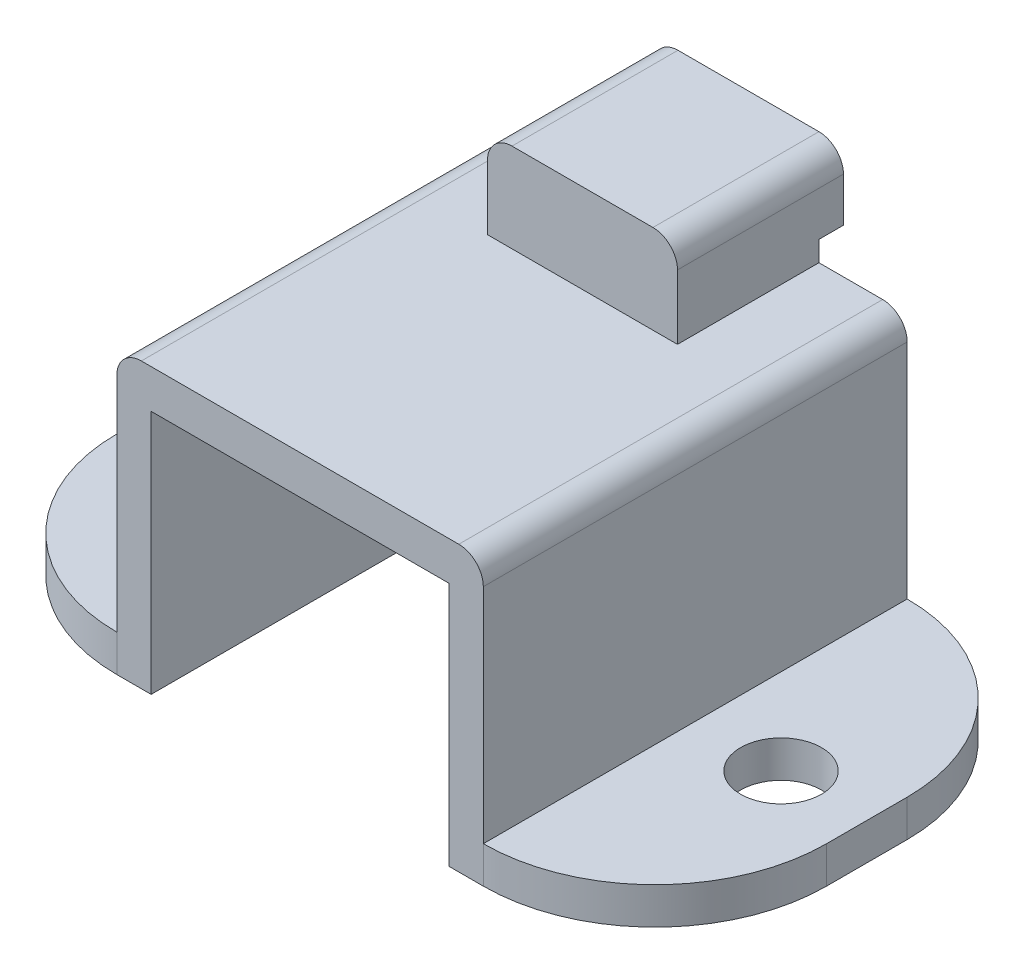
from build123d import *

# Parameters (mm, degrees)
BOSS_EXTRUDE1_DEPTH  = 9.17
BOSS_EXTRUDE5_DEPTH  = 2.35
BOSS_EXTRUDE6_DEPTH  = 1.07
BOSS_EXTRUDE7_DEPTH  = 4.7
SKETCH11_W           = 7.75
SKETCH11_H           = 5.21
BOSS_EXTRUDE8_DEPTH  = 1.07
FILLET4_R            = 1
SKETCH12_W           = 8.4
SKETCH12_H           = 17.29
SKETCH12_R           = 1.65
BOSS_EXTRUDE9_DEPTH  = 1.5
FILLET6_R            = 7
BOSS_EXTRUDE10_START = 1
BOSS_EXTRUDE10_DEPTH = 1


with BuildPart() as part:
    # Sketch1 → Boss-Extrude1 (new body)
    with BuildSketch(Plane.XY):
        Polygon((-7.475, 11.58), (7.475, 11.58), (7.475, 0), (6.075, 0), (6.075, 10), (-6.075, 10), (-6.075, 0), (-7.475, 0), align=None)
    extrude(amount=BOSS_EXTRUDE1_DEPTH)

    # Sketch5 → Boss-Extrude5 (add)
    with BuildSketch(Plane(origin=(0, 0, 0), x_dir=(-1, 0, 0), z_dir=(0, 0, -1))):
        with BuildLine():
            Line((6.075, 0), (7.475, 0))
            Line((7.475, 0), (7.475, 11.58))
            Line((7.475, 11.58), (-7.475, 11.58))
            Line((-7.475, 11.58), (-7.475, 0))
            Line((-7.475, 0), (-6.075, 0))
            Line((-6.075, 0), (-6.075, 7))
            ThreePointArc((-6.075, 7), (-5.196320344, 9.121320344), (-3.075, 10))
            Line((-3.075, 10), (3.075, 10))
            ThreePointArc((3.075, 10), (5.196320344, 9.121320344), (6.075, 7))
            Line((6.075, 7), (6.075, 0))
        make_face()
    extrude(amount=BOSS_EXTRUDE5_DEPTH)



with BuildPart() as body_2:
    # Sketch9 → Boss-Extrude6 (new body)
    with BuildSketch(Plane(origin=(0, 0, -2.35), x_dir=(-1, 0, 0), z_dir=(0, 0, -1))):
        with BuildLine():
            Line((6.075, 7), (6.075, 0))
            Line((6.075, 0), (7.475, 0))
            Line((7.475, 0), (7.475, 11.58))
            Line((7.475, 11.58), (-7.475, 11.58))
            Line((-7.475, 11.58), (-7.475, 0))
            Line((-7.475, 0), (-6.075, 0))
            Line((-6.075, 0), (-6.075, 7))
            ThreePointArc((-6.075, 7), (-5.196320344, 9.121320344), (-3.075, 10))
            Line((-3.075, 10), (3.075, 10))
            ThreePointArc((3.075, 10), (5.196320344, 9.121320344), (6.075, 7))
        make_face()
    extrude(amount=BOSS_EXTRUDE6_DEPTH)

    # Sketch10 → Boss-Extrude7 (add)
    with BuildSketch(Plane(origin=(0, 0, -3.42), x_dir=(-1, 0, 0), z_dir=(0, 0, -1))):
        with BuildLine():
            Line((-2.375, 10), (-2.375, 11.58))
            Line((-2.375, 11.58), (-3.875, 11.58))
            Line((-3.875, 11.58), (-7.475, 11.58))
            Line((-7.475, 11.58), (-7.475, 0))
            Line((-7.475, 0), (-6.075, 0))
            Line((-6.075, 0), (-6.075, 7))
            ThreePointArc((-6.075, 7), (-5.196320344, 9.121320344), (-3.075, 10))
            Line((-3.075, 10), (-2.375, 10))
        make_face()
        Polygon((-2.375, 11.58), (-2.375, 13.61), (2.375, 13.61), (2.375, 11.58), (3.875, 11.58), (3.875, 15.21), (-3.875, 15.21), (-3.875, 11.58), align=None)
        with BuildLine():
            Line((3.875, 11.58), (2.375, 11.58))
            Line((2.375, 11.58), (2.375, 10))
            Line((2.375, 10), (3.075, 10))
            ThreePointArc((3.075, 10), (5.196320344, 9.121320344), (6.075, 7))
            Line((6.075, 7), (6.075, 0))
            Line((6.075, 0), (7.475, 0))
            Line((7.475, 0), (7.475, 11.58))
            Line((7.475, 11.58), (3.875, 11.58))
        make_face()
    extrude(amount=BOSS_EXTRUDE7_DEPTH)


with BuildPart() as part_1:
    add(part.part)

    add(body_2.part)  # Boss-Extrude8 merges body 2
    # Sketch11 → Boss-Extrude8 (add)
    with BuildSketch(Plane.XY.offset(-3.42)):
        with Locations((0, 12.605)):
            Rectangle(SKETCH11_W, SKETCH11_H)
    extrude(amount=BOSS_EXTRUDE8_DEPTH)

    # Fillet4
    fillet4_edges = [part_1.edges().sort_by_distance(p)[0] for p in [
        (-7.475, 11.58, 0.525),
        (7.475, 11.58, 0.525),
        (-3.875, 15.21, -5.235),
        (3.875, 15.21, -5.235),
        (2.375, 13.61, -5.77),
        (-2.375, 13.61, -5.77),
    ]]
    fillet(fillet4_edges, radius=FILLET4_R)

    # Sketch12 → Boss-Extrude9 (add)
    with BuildSketch(Plane.XZ):
        with Locations((10.275, 0.525)):
            Rectangle(SKETCH12_W, SKETCH12_H)
        with Locations((10.975, 0.525)):
            Circle(SKETCH12_R, mode=Mode.SUBTRACT)
    boss_extrude9 = extrude(amount=-BOSS_EXTRUDE9_DEPTH)

    # Mirror1: Boss-Extrude9 across plane
    add(boss_extrude9.mirror(Plane(origin=(0, 0, 0), x_dir=(0, 0, 1), z_dir=(1, 0, 0))))

    # Fillet6
    fillet6_edges = [part_1.edges().sort_by_distance(p)[0] for p in [
        (-14.475, 0.75, 9.17),
        (-14.475, 0.75, -8.12),
        (14.475, 0.75, -8.12),
        (14.475, 0.75, 9.17),
    ]]
    fillet(fillet6_edges, radius=FILLET6_R)

    # Sketch14 → Boss-Extrude10 (add)
    with BuildSketch(Plane(origin=(0, 0, -8.12), x_dir=(-1, 0, 0), z_dir=(0, 0, -1)).offset(BOSS_EXTRUDE10_START)):
        with BuildLine():
            Line((-3.875, 14.21), (-3.875, 12.40389024))
            Line((-3.875, 12.40389024), (-2.375, 12.40389024))
            Line((-2.375, 12.40389024), (-2.375, 12.61))
            ThreePointArc((-2.375, 12.61), (-2.082106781, 13.317106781), (-1.375, 13.61))
            Line((-1.375, 13.61), (1.375, 13.61))
            ThreePointArc((1.375, 13.61), (2.082106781, 13.317106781), (2.375, 12.61))
            Line((2.375, 12.61), (2.375, 12.40389024))
            Line((2.375, 12.40389024), (3.875, 12.40389024))
            Line((3.875, 12.40389024), (3.875, 14.21))
            ThreePointArc((3.875, 14.21), (3.582106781, 14.917106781), (2.875, 15.21))
            Line((2.875, 15.21), (-2.875, 15.21))
            ThreePointArc((-2.875, 15.21), (-3.582106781, 14.917106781), (-3.875, 14.21))
        make_face()
        with BuildLine():
            Line((-2.375, 12.61), (-2.375, 12.40389024))
            Line((-2.375, 12.40389024), (2.375, 12.40389024))
            Line((2.375, 12.40389024), (2.375, 12.61))
            ThreePointArc((2.375, 12.61), (2.082106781, 13.317106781), (1.375, 13.61))
            Line((1.375, 13.61), (-1.375, 13.61))
            ThreePointArc((-1.375, 13.61), (-2.082106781, 13.317106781), (-2.375, 12.61))
        make_face()
    extrude(amount=-BOSS_EXTRUDE10_DEPTH)


solid = part_1.part
